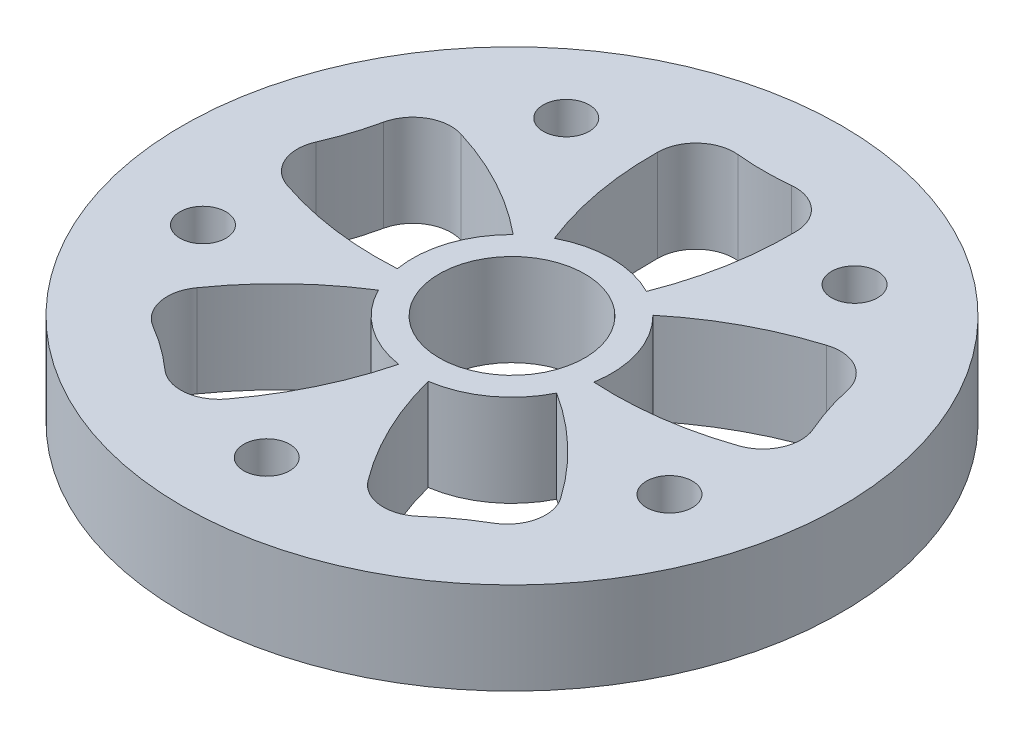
ISO-10303-21;
HEADER;
FILE_DESCRIPTION(('STEP AP214'),'2;1');
FILE_NAME('part.step','',(''),(''),'','','');
FILE_SCHEMA(('AUTOMOTIVE_DESIGN { 1 0 10303 214 1 1 1 1 }'));
ENDSEC;
DATA;
#1=APPLICATION_CONTEXT('core data for automotive mechanical design processes');
#2=APPLICATION_PROTOCOL_DEFINITION('international standard','automotive_design',2000,#1);
#3=PRODUCT_CONTEXT('',#1,'mechanical');
#4=PRODUCT('Part','Part','',(#3));
#5=PRODUCT_RELATED_PRODUCT_CATEGORY('part','',(#4));
#6=PRODUCT_DEFINITION_FORMATION('','',#4);
#7=PRODUCT_DEFINITION_CONTEXT('part definition',#1,'design');
#8=PRODUCT_DEFINITION('design','',#6,#7);
#9=PRODUCT_DEFINITION_SHAPE('','',#8);
#10=(LENGTH_UNIT() NAMED_UNIT(*) SI_UNIT(.MILLI.,.METRE.));
#11=(NAMED_UNIT(*) PLANE_ANGLE_UNIT() SI_UNIT($,.RADIAN.));
#12=(NAMED_UNIT(*) SI_UNIT($,.STERADIAN.) SOLID_ANGLE_UNIT());
#13=UNCERTAINTY_MEASURE_WITH_UNIT(LENGTH_MEASURE(1.E-05),#10,'distance_accuracy_value','');
#14=(GEOMETRIC_REPRESENTATION_CONTEXT(3) GLOBAL_UNCERTAINTY_ASSIGNED_CONTEXT((#13)) GLOBAL_UNIT_ASSIGNED_CONTEXT((#10,
#11,#12)) REPRESENTATION_CONTEXT('',''));
#15=CARTESIAN_POINT('',(0.,0.,0.));
#16=DIRECTION('',(0.,0.,1.));
#17=DIRECTION('',(1.,0.,0.));
#18=AXIS2_PLACEMENT_3D('',#15,#16,#17);
#19=CARTESIAN_POINT('',(0.,6.,0.));
#20=DIRECTION('',(0.,1.,0.));
#21=DIRECTION('',(0.,0.,1.));
#22=AXIS2_PLACEMENT_3D('',#19,#20,#21);
#23=PLANE('',#22);
#24=CARTESIAN_POINT('',(-15.4833344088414,6.,-40.7749964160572));
#25=DIRECTION('',(0.,1.,0.));
#26=DIRECTION('',(0.,0.,-1.));
#27=AXIS2_PLACEMENT_3D('',#24,#25,#26);
#28=CIRCLE('',#27,43.);
#29=CARTESIAN_POINT('',(-29.4107354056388,6.,-0.0929671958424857));
#30=VERTEX_POINT('',#29);
#31=CARTESIAN_POINT('',(-12.8222207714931,6.,2.14258126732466));
#32=VERTEX_POINT('',#31);
#33=EDGE_CURVE('E63',#30,#32,#28,.T.);
#34=ORIENTED_EDGE('',*,*,#33,.F.);
#35=CARTESIAN_POINT('',(-27.865650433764,6.,-4.84824977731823));
#36=DIRECTION('',(0.,1.,0.));
#37=DIRECTION('',(0.,0.,-1.));
#38=AXIS2_PLACEMENT_3D('',#35,#36,#37);
#39=CIRCLE('',#38,5.);
#40=CARTESIAN_POINT('',(-32.4425883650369,6.,-6.86111817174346));
#41=VERTEX_POINT('',#40);
#42=EDGE_CURVE('E482',#41,#30,#39,.T.);
#43=ORIENTED_EDGE('',*,*,#42,.F.);
#44=CARTESIAN_POINT('',(-64.4811538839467,6.,-20.95119693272));
#45=DIRECTION('',(0.,-1.,0.));
#46=DIRECTION('',(0.,0.,1.));
#47=AXIS2_PLACEMENT_3D('',#44,#45,#46);
#48=CIRCLE('',#47,35.);
#49=CARTESIAN_POINT('',(-30.2794694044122,6.,-13.5185137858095));
#50=VERTEX_POINT('',#49);
#51=EDGE_CURVE('E488',#50,#41,#48,.T.);
#52=ORIENTED_EDGE('',*,*,#51,.F.);
#53=CARTESIAN_POINT('',(-25.3935144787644,6.,-12.4567019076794));
#54=DIRECTION('',(0.,1.,0.));
#55=DIRECTION('',(0.,0.,1.));
#56=AXIS2_PLACEMENT_3D('',#53,#54,#55);
#57=CIRCLE('',#56,5.);
#58=CARTESIAN_POINT('',(-23.8484295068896,6.,-17.2119844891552));
#59=VERTEX_POINT('',#58);
#60=EDGE_CURVE('E495',#59,#50,#57,.T.);
#61=ORIENTED_EDGE('',*,*,#60,.F.);
#62=CARTESIAN_POINT('',(-36.4932222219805,6.,23.8867894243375));
#63=DIRECTION('',(0.,1.,0.));
#64=DIRECTION('',(0.,0.,1.));
#65=AXIS2_PLACEMENT_3D('',#62,#63,#64);
#66=CIRCLE('',#65,43.);
#67=CARTESIAN_POINT('',(-9.11401683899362,6.,-9.27009692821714));
#68=VERTEX_POINT('',#67);
#69=EDGE_CURVE('E497',#68,#59,#66,.T.);
#70=ORIENTED_EDGE('',*,*,#69,.F.);
#71=CARTESIAN_POINT('',(0.,6.,0.));
#72=DIRECTION('',(0.,-1.,0.));
#73=DIRECTION('',(0.,0.,1.));
#74=AXIS2_PLACEMENT_3D('',#71,#72,#73);
#75=CIRCLE('',#74,13.);
#76=EDGE_CURVE('E498',#32,#68,#75,.T.);
#77=ORIENTED_EDGE('',*,*,#76,.F.);
#78=EDGE_LOOP('',(#34,#43,#52,#61,#70,#77));
#79=FACE_BOUND('',#78,.T.);
#80=CARTESIAN_POINT('',(0.,6.,0.));
#81=DIRECTION('',(0.,-1.,0.));
#82=DIRECTION('',(0.,0.,1.));
#83=AXIS2_PLACEMENT_3D('',#80,#81,#82);
#84=CIRCLE('',#83,13.);
#85=CARTESIAN_POINT('',(-1.92456824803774,6.,12.8567506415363));
#86=VERTEX_POINT('',#85);
#87=CARTESIAN_POINT('',(-11.632772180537,6.,5.80332761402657));
#88=VERTEX_POINT('',#87);
#89=EDGE_CURVE('E66',#86,#88,#84,.T.);
#90=ORIENTED_EDGE('',*,*,#89,.F.);
#91=CARTESIAN_POINT('',(-43.5639395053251,6.,2.12535924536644));
#92=DIRECTION('',(0.,1.,0.));
#93=DIRECTION('',(0.,0.,-1.));
#94=AXIS2_PLACEMENT_3D('',#91,#92,#93);
#95=CIRCLE('',#94,43.);
#96=CARTESIAN_POINT('',(-9.17683411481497,6.,27.9425431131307));
#97=VERTEX_POINT('',#96);
#98=EDGE_CURVE('E419',#97,#86,#95,.T.);
#99=ORIENTED_EDGE('',*,*,#98,.F.);
#100=CARTESIAN_POINT('',(-13.2219190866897,6.,25.0036168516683));
#101=DIRECTION('',(0.,1.,0.));
#102=DIRECTION('',(0.,0.,-1.));
#103=AXIS2_PLACEMENT_3D('',#100,#101,#102);
#104=CIRCLE('',#103,5.);
#105=CARTESIAN_POINT('',(-16.550622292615,6.,28.7345329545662));
#106=VERTEX_POINT('',#105);
#107=EDGE_CURVE('E424',#106,#97,#104,.T.);
#108=ORIENTED_EDGE('',*,*,#107,.F.);
#109=CARTESIAN_POINT('',(-39.851544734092,6.,54.8509456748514));
#110=DIRECTION('',(0.,-1.,0.));
#111=DIRECTION('',(0.,0.,1.));
#112=AXIS2_PLACEMENT_3D('',#109,#110,#111);
#113=CIRCLE('',#112,35.);
#114=CARTESIAN_POINT('',(-22.2137412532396,6.,24.6200361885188));
#115=VERTEX_POINT('',#114);
#116=EDGE_CURVE('E428',#115,#106,#113,.T.);
#117=ORIENTED_EDGE('',*,*,#116,.F.);
#118=CARTESIAN_POINT('',(-19.6940550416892,6.,20.3013348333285));
#119=DIRECTION('',(0.,1.,0.));
#120=DIRECTION('',(0.,0.,1.));
#121=AXIS2_PLACEMENT_3D('',#118,#119,#120);
#122=CIRCLE('',#121,5.);
#123=CARTESIAN_POINT('',(-23.7391400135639,6.,17.3624085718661));
#124=VERTEX_POINT('',#123);
#125=EDGE_CURVE('E435',#124,#115,#122,.T.);
#126=ORIENTED_EDGE('',*,*,#125,.F.);
#127=CARTESIAN_POINT('',(11.440660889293,6.,42.0885406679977));
#128=DIRECTION('',(0.,1.,0.));
#129=DIRECTION('',(0.,0.,1.));
#130=AXIS2_PLACEMENT_3D('',#127,#128,#129);
#131=CIRCLE('',#130,43.);
#132=EDGE_CURVE('E436',#88,#124,#131,.T.);
#133=ORIENTED_EDGE('',*,*,#132,.F.);
#134=EDGE_LOOP('',(#90,#99,#108,#117,#126,#133));
#135=FACE_BOUND('',#134,.T.);
#136=CARTESIAN_POINT('',(0.,6.,0.));
#137=DIRECTION('',(0.,-1.,0.));
#138=DIRECTION('',(0.,0.,1.));
#139=AXIS2_PLACEMENT_3D('',#136,#137,#138);
#140=CIRCLE('',#139,13.);
#141=CARTESIAN_POINT('',(11.632772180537,6.,5.80332761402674));
#142=VERTEX_POINT('',#141);
#143=CARTESIAN_POINT('',(1.92456824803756,6.,12.8567506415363));
#144=VERTEX_POINT('',#143);
#145=EDGE_CURVE('E254',#142,#144,#140,.T.);
#146=ORIENTED_EDGE('',*,*,#145,.F.);
#147=CARTESIAN_POINT('',(-11.4406608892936,6.,42.0885406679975));
#148=DIRECTION('',(0.,1.,0.));
#149=DIRECTION('',(0.,0.,-1.));
#150=AXIS2_PLACEMENT_3D('',#147,#148,#149);
#151=CIRCLE('',#150,43.);
#152=CARTESIAN_POINT('',(23.7391400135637,6.,17.3624085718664));
#153=VERTEX_POINT('',#152);
#154=EDGE_CURVE('E357',#153,#142,#151,.T.);
#155=ORIENTED_EDGE('',*,*,#154,.F.);
#156=CARTESIAN_POINT('',(19.6940550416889,6.,20.3013348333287));
#157=DIRECTION('',(0.,1.,0.));
#158=DIRECTION('',(0.,0.,-1.));
#159=AXIS2_PLACEMENT_3D('',#156,#157,#158);
#160=CIRCLE('',#159,5.);
#161=CARTESIAN_POINT('',(22.2137412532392,6.,24.6200361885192));
#162=VERTEX_POINT('',#161);
#163=EDGE_CURVE('E358',#162,#153,#160,.T.);
#164=ORIENTED_EDGE('',*,*,#163,.F.);
#165=CARTESIAN_POINT('',(39.8515447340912,6.,54.8509456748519));
#166=DIRECTION('',(0.,-1.,0.));
#167=DIRECTION('',(0.,0.,1.));
#168=AXIS2_PLACEMENT_3D('',#165,#166,#167);
#169=CIRCLE('',#168,35.);
#170=CARTESIAN_POINT('',(16.5506222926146,6.,28.7345329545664));
#171=VERTEX_POINT('',#170);
#172=EDGE_CURVE('E365',#171,#162,#169,.T.);
#173=ORIENTED_EDGE('',*,*,#172,.F.);
#174=CARTESIAN_POINT('',(13.2219190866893,6.,25.0036168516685));
#175=DIRECTION('',(0.,1.,0.));
#176=DIRECTION('',(0.,0.,1.));
#177=AXIS2_PLACEMENT_3D('',#174,#175,#176);
#178=CIRCLE('',#177,5.);
#179=CARTESIAN_POINT('',(9.17683411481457,6.,27.9425431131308));
#180=VERTEX_POINT('',#179);
#181=EDGE_CURVE('E366',#180,#171,#178,.T.);
#182=ORIENTED_EDGE('',*,*,#181,.F.);
#183=CARTESIAN_POINT('',(43.5639395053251,6.,2.12535924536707));
#184=DIRECTION('',(0.,1.,0.));
#185=DIRECTION('',(0.,0.,1.));
#186=AXIS2_PLACEMENT_3D('',#183,#184,#185);
#187=CIRCLE('',#186,43.);
#188=EDGE_CURVE('E375',#144,#180,#187,.T.);
#189=ORIENTED_EDGE('',*,*,#188,.F.);
#190=EDGE_LOOP('',(#146,#155,#164,#173,#182,#189));
#191=FACE_BOUND('',#190,.T.);
#192=CARTESIAN_POINT('',(0.,6.,0.));
#193=DIRECTION('',(0.,-1.,0.));
#194=DIRECTION('',(0.,0.,1.));
#195=AXIS2_PLACEMENT_3D('',#192,#193,#194);
#196=CIRCLE('',#195,13.);
#197=CARTESIAN_POINT('',(9.11401683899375,6.,-9.27009692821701));
#198=VERTEX_POINT('',#197);
#199=CARTESIAN_POINT('',(12.8222207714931,6.,2.14258126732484));
#200=VERTEX_POINT('',#199);
#201=EDGE_CURVE('E310',#198,#200,#196,.T.);
#202=ORIENTED_EDGE('',*,*,#201,.F.);
#203=CARTESIAN_POINT('',(36.4932222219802,6.,23.886789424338));
#204=DIRECTION('',(0.,1.,0.));
#205=DIRECTION('',(0.,0.,-1.));
#206=AXIS2_PLACEMENT_3D('',#203,#204,#205);
#207=CIRCLE('',#206,43.);
#208=CARTESIAN_POINT('',(23.8484295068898,6.,-17.2119844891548));
#209=VERTEX_POINT('',#208);
#210=EDGE_CURVE('E248',#209,#198,#207,.T.);
#211=ORIENTED_EDGE('',*,*,#210,.F.);
#212=CARTESIAN_POINT('',(25.3935144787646,6.,-12.4567019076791));
#213=DIRECTION('',(0.,1.,0.));
#214=DIRECTION('',(0.,0.,-1.));
#215=AXIS2_PLACEMENT_3D('',#212,#213,#214);
#216=CIRCLE('',#215,5.);
#217=CARTESIAN_POINT('',(30.2794694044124,6.,-13.5185137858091));
#218=VERTEX_POINT('',#217);
#219=EDGE_CURVE('E291',#218,#209,#216,.T.);
#220=ORIENTED_EDGE('',*,*,#219,.F.);
#221=CARTESIAN_POINT('',(64.481153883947,6.,-20.9511969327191));
#222=DIRECTION('',(0.,-1.,0.));
#223=DIRECTION('',(0.,0.,1.));
#224=AXIS2_PLACEMENT_3D('',#221,#222,#223);
#225=CIRCLE('',#224,35.);
#226=CARTESIAN_POINT('',(32.442588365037,6.,-6.861118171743));
#227=VERTEX_POINT('',#226);
#228=EDGE_CURVE('E299',#227,#218,#225,.T.);
#229=ORIENTED_EDGE('',*,*,#228,.F.);
#230=CARTESIAN_POINT('',(27.8656504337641,6.,-4.84824977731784));
#231=DIRECTION('',(0.,1.,0.));
#232=DIRECTION('',(0.,0.,1.));
#233=AXIS2_PLACEMENT_3D('',#230,#231,#232);
#234=CIRCLE('',#233,5.);
#235=CARTESIAN_POINT('',(29.4107354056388,6.,-0.0929671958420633));
#236=VERTEX_POINT('',#235);
#237=EDGE_CURVE('E302',#236,#227,#234,.T.);
#238=ORIENTED_EDGE('',*,*,#237,.F.);
#239=CARTESIAN_POINT('',(15.483334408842,6.,-40.774996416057));
#240=DIRECTION('',(0.,1.,0.));
#241=DIRECTION('',(0.,0.,1.));
#242=AXIS2_PLACEMENT_3D('',#239,#240,#241);
#243=CIRCLE('',#242,43.);
#244=EDGE_CURVE('E303',#200,#236,#243,.T.);
#245=ORIENTED_EDGE('',*,*,#244,.F.);
#246=EDGE_LOOP('',(#202,#211,#220,#229,#238,#245));
#247=FACE_BOUND('',#246,.T.);
#248=CARTESIAN_POINT('',(0.,6.,0.));
#249=DIRECTION('',(0.,-1.,0.));
#250=DIRECTION('',(0.,0.,1.));
#251=AXIS2_PLACEMENT_3D('',#248,#249,#250);
#252=CIRCLE('',#251,13.);
#253=CARTESIAN_POINT('',(-6.,6.,-11.5325625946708));
#254=VERTEX_POINT('',#253);
#255=CARTESIAN_POINT('',(5.99999999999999,6.,-11.5325625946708));
#256=VERTEX_POINT('',#255);
#257=EDGE_CURVE('E315',#254,#256,#252,.T.);
#258=ORIENTED_EDGE('',*,*,#257,.F.);
#259=CARTESIAN_POINT('',(33.9947125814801,6.,-27.3256929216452));
#260=DIRECTION('',(0.,1.,0.));
#261=DIRECTION('',(0.,0.,-1.));
#262=AXIS2_PLACEMENT_3D('',#259,#260,#261);
#263=CIRCLE('',#262,43.);
#264=CARTESIAN_POINT('',(-8.99999999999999,6.,-28.));
#265=VERTEX_POINT('',#264);
#266=EDGE_CURVE('E521',#265,#254,#263,.T.);
#267=ORIENTED_EDGE('',*,*,#266,.F.);
#268=CARTESIAN_POINT('',(-3.99999999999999,6.,-28.));
#269=DIRECTION('',(0.,1.,0.));
#270=DIRECTION('',(0.,0.,-1.));
#271=AXIS2_PLACEMENT_3D('',#268,#269,#270);
#272=CIRCLE('',#271,5.);
#273=CARTESIAN_POINT('',(-3.49999999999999,6.,-32.9749371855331));
#274=VERTEX_POINT('',#273);
#275=EDGE_CURVE('E516',#274,#265,#272,.T.);
#276=ORIENTED_EDGE('',*,*,#275,.F.);
#277=CARTESIAN_POINT('',(0.,6.,-67.7994974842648));
#278=DIRECTION('',(0.,-1.,0.));
#279=DIRECTION('',(0.,0.,1.));
#280=AXIS2_PLACEMENT_3D('',#277,#278,#279);
#281=CIRCLE('',#280,35.);
#282=CARTESIAN_POINT('',(3.5,6.,-32.9749371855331));
#283=VERTEX_POINT('',#282);
#284=EDGE_CURVE('E518',#283,#274,#281,.T.);
#285=ORIENTED_EDGE('',*,*,#284,.F.);
#286=CARTESIAN_POINT('',(3.99999999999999,6.,-28.));
#287=DIRECTION('',(0.,1.,0.));
#288=DIRECTION('',(0.,0.,1.));
#289=AXIS2_PLACEMENT_3D('',#286,#287,#288);
#290=CIRCLE('',#289,5.);
#291=CARTESIAN_POINT('',(8.99999999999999,6.,-28.));
#292=VERTEX_POINT('',#291);
#293=EDGE_CURVE('E515',#292,#283,#290,.T.);
#294=ORIENTED_EDGE('',*,*,#293,.F.);
#295=CARTESIAN_POINT('',(-33.9947125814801,6.,-27.3256929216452));
#296=DIRECTION('',(0.,1.,0.));
#297=DIRECTION('',(0.,0.,1.));
#298=AXIS2_PLACEMENT_3D('',#295,#296,#297);
#299=CIRCLE('',#298,43.);
#300=EDGE_CURVE('E509',#256,#292,#299,.T.);
#301=ORIENTED_EDGE('',*,*,#300,.F.);
#302=EDGE_LOOP('',(#258,#267,#276,#285,#294,#301));
#303=FACE_BOUND('',#302,.T.);
#304=CARTESIAN_POINT('',(18.8091280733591,6.,-25.8885438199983));
#305=DIRECTION('',(0.,1.,0.));
#306=DIRECTION('',(0.,0.,1.));
#307=AXIS2_PLACEMENT_3D('',#304,#305,#306);
#308=CIRCLE('',#307,3.);
#309=CARTESIAN_POINT('',(18.8091280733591,6.,-22.8885438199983));
#310=VERTEX_POINT('',#309);
#311=EDGE_CURVE('E578',#310,#310,#308,.T.);
#312=ORIENTED_EDGE('',*,*,#311,.F.);
#313=EDGE_LOOP('',(#312));
#314=FACE_BOUND('',#313,.T.);
#315=CARTESIAN_POINT('',(-30.4338085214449,6.,9.88854381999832));
#316=DIRECTION('',(0.,1.,0.));
#317=DIRECTION('',(0.,0.,1.));
#318=AXIS2_PLACEMENT_3D('',#315,#316,#317);
#319=CIRCLE('',#318,3.);
#320=CARTESIAN_POINT('',(-30.4338085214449,6.,12.8885438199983));
#321=VERTEX_POINT('',#320);
#322=EDGE_CURVE('E596',#321,#321,#319,.T.);
#323=ORIENTED_EDGE('',*,*,#322,.F.);
#324=EDGE_LOOP('',(#323));
#325=FACE_BOUND('',#324,.T.);
#326=CARTESIAN_POINT('',(0.,6.,0.));
#327=DIRECTION('',(0.,1.,0.));
#328=DIRECTION('',(0.,0.,1.));
#329=AXIS2_PLACEMENT_3D('',#326,#327,#328);
#330=CIRCLE('',#329,9.5);
#331=CARTESIAN_POINT('',(0.,6.,9.5));
#332=VERTEX_POINT('',#331);
#333=EDGE_CURVE('E614',#332,#332,#330,.T.);
#334=ORIENTED_EDGE('',*,*,#333,.F.);
#335=EDGE_LOOP('',(#334));
#336=FACE_BOUND('',#335,.T.);
#337=CARTESIAN_POINT('',(0.,6.,0.));
#338=DIRECTION('',(0.,1.,0.));
#339=DIRECTION('',(0.,0.,1.));
#340=AXIS2_PLACEMENT_3D('',#337,#338,#339);
#341=CIRCLE('',#340,43.);
#342=CARTESIAN_POINT('',(0.,6.,43.));
#343=VERTEX_POINT('',#342);
#344=EDGE_CURVE('E11',#343,#343,#341,.T.);
#345=ORIENTED_EDGE('',*,*,#344,.T.);
#346=EDGE_LOOP('',(#345));
#347=FACE_BOUND('',#346,.T.);
#348=CARTESIAN_POINT('',(0.,6.,32.));
#349=DIRECTION('',(0.,1.,0.));
#350=DIRECTION('',(0.,0.,1.));
#351=AXIS2_PLACEMENT_3D('',#348,#349,#350);
#352=CIRCLE('',#351,3.);
#353=CARTESIAN_POINT('',(0.,6.,35.));
#354=VERTEX_POINT('',#353);
#355=EDGE_CURVE('E603',#354,#354,#352,.T.);
#356=ORIENTED_EDGE('',*,*,#355,.F.);
#357=EDGE_LOOP('',(#356));
#358=FACE_BOUND('',#357,.T.);
#359=CARTESIAN_POINT('',(-18.8091280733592,6.,-25.8885438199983));
#360=DIRECTION('',(0.,1.,0.));
#361=DIRECTION('',(0.,0.,1.));
#362=AXIS2_PLACEMENT_3D('',#359,#360,#361);
#363=CIRCLE('',#362,3.);
#364=CARTESIAN_POINT('',(-18.8091280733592,6.,-22.8885438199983));
#365=VERTEX_POINT('',#364);
#366=EDGE_CURVE('E586',#365,#365,#363,.T.);
#367=ORIENTED_EDGE('',*,*,#366,.F.);
#368=EDGE_LOOP('',(#367));
#369=FACE_BOUND('',#368,.T.);
#370=CARTESIAN_POINT('',(30.4338085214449,6.,9.88854381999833));
#371=DIRECTION('',(0.,1.,0.));
#372=DIRECTION('',(0.,0.,1.));
#373=AXIS2_PLACEMENT_3D('',#370,#371,#372);
#374=CIRCLE('',#373,2.99999999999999);
#375=CARTESIAN_POINT('',(30.4338085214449,6.,12.8885438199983));
#376=VERTEX_POINT('',#375);
#377=EDGE_CURVE('E574',#376,#376,#374,.T.);
#378=ORIENTED_EDGE('',*,*,#377,.F.);
#379=EDGE_LOOP('',(#378));
#380=FACE_BOUND('',#379,.T.);
#381=ADVANCED_FACE('F44',(#79,#135,#191,#247,#303,#314,#325,#336,#347,#358,#369,#380),#23,.T.);
#382=CARTESIAN_POINT('',(0.,-6.,0.));
#383=DIRECTION('',(0.,1.,0.));
#384=DIRECTION('',(0.,0.,1.));
#385=AXIS2_PLACEMENT_3D('',#382,#383,#384);
#386=PLANE('',#385);
#387=CARTESIAN_POINT('',(-27.865650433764,-6.,-4.84824977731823));
#388=DIRECTION('',(0.,1.,0.));
#389=DIRECTION('',(0.,0.,-1.));
#390=AXIS2_PLACEMENT_3D('',#387,#388,#389);
#391=CIRCLE('',#390,5.);
#392=CARTESIAN_POINT('',(-32.4425883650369,-6.,-6.86111817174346));
#393=VERTEX_POINT('',#392);
#394=CARTESIAN_POINT('',(-29.4107354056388,-6.,-0.0929671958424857));
#395=VERTEX_POINT('',#394);
#396=EDGE_CURVE('E443',#393,#395,#391,.T.);
#397=ORIENTED_EDGE('',*,*,#396,.T.);
#398=CARTESIAN_POINT('',(-15.4833344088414,-6.,-40.7749964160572));
#399=DIRECTION('',(0.,1.,0.));
#400=DIRECTION('',(0.,0.,-1.));
#401=AXIS2_PLACEMENT_3D('',#398,#399,#400);
#402=CIRCLE('',#401,43.);
#403=CARTESIAN_POINT('',(-12.8222207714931,-6.,2.14258126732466));
#404=VERTEX_POINT('',#403);
#405=EDGE_CURVE('E477',#395,#404,#402,.T.);
#406=ORIENTED_EDGE('',*,*,#405,.T.);
#407=CARTESIAN_POINT('',(0.,-6.,0.));
#408=DIRECTION('',(0.,-1.,0.));
#409=DIRECTION('',(0.,0.,1.));
#410=AXIS2_PLACEMENT_3D('',#407,#408,#409);
#411=CIRCLE('',#410,13.);
#412=CARTESIAN_POINT('',(-9.11401683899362,-6.,-9.27009692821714));
#413=VERTEX_POINT('',#412);
#414=EDGE_CURVE('E478',#404,#413,#411,.T.);
#415=ORIENTED_EDGE('',*,*,#414,.T.);
#416=CARTESIAN_POINT('',(-36.4932222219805,-6.,23.8867894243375));
#417=DIRECTION('',(0.,1.,0.));
#418=DIRECTION('',(0.,0.,1.));
#419=AXIS2_PLACEMENT_3D('',#416,#417,#418);
#420=CIRCLE('',#419,43.);
#421=CARTESIAN_POINT('',(-23.8484295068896,-6.,-17.2119844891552));
#422=VERTEX_POINT('',#421);
#423=EDGE_CURVE('E472',#413,#422,#420,.T.);
#424=ORIENTED_EDGE('',*,*,#423,.T.);
#425=CARTESIAN_POINT('',(-25.3935144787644,-6.,-12.4567019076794));
#426=DIRECTION('',(0.,1.,0.));
#427=DIRECTION('',(0.,0.,1.));
#428=AXIS2_PLACEMENT_3D('',#425,#426,#427);
#429=CIRCLE('',#428,5.);
#430=CARTESIAN_POINT('',(-30.2794694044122,-6.,-13.5185137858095));
#431=VERTEX_POINT('',#430);
#432=EDGE_CURVE('E469',#422,#431,#429,.T.);
#433=ORIENTED_EDGE('',*,*,#432,.T.);
#434=CARTESIAN_POINT('',(-64.4811538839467,-6.,-20.95119693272));
#435=DIRECTION('',(0.,-1.,0.));
#436=DIRECTION('',(0.,0.,1.));
#437=AXIS2_PLACEMENT_3D('',#434,#435,#436);
#438=CIRCLE('',#437,35.);
#439=EDGE_CURVE('E465',#431,#393,#438,.T.);
#440=ORIENTED_EDGE('',*,*,#439,.T.);
#441=EDGE_LOOP('',(#397,#406,#415,#424,#433,#440));
#442=FACE_BOUND('',#441,.T.);
#443=CARTESIAN_POINT('',(-43.5639395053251,-6.,2.12535924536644));
#444=DIRECTION('',(0.,1.,0.));
#445=DIRECTION('',(0.,0.,-1.));
#446=AXIS2_PLACEMENT_3D('',#443,#444,#445);
#447=CIRCLE('',#446,43.);
#448=CARTESIAN_POINT('',(-9.17683411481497,-6.,27.9425431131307));
#449=VERTEX_POINT('',#448);
#450=CARTESIAN_POINT('',(-1.92456824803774,-6.,12.8567506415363));
#451=VERTEX_POINT('',#450);
#452=EDGE_CURVE('E381',#449,#451,#447,.T.);
#453=ORIENTED_EDGE('',*,*,#452,.T.);
#454=CARTESIAN_POINT('',(0.,-6.,0.));
#455=DIRECTION('',(0.,-1.,0.));
#456=DIRECTION('',(0.,0.,1.));
#457=AXIS2_PLACEMENT_3D('',#454,#455,#456);
#458=CIRCLE('',#457,13.);
#459=CARTESIAN_POINT('',(-11.632772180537,-6.,5.80332761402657));
#460=VERTEX_POINT('',#459);
#461=EDGE_CURVE('E418',#451,#460,#458,.T.);
#462=ORIENTED_EDGE('',*,*,#461,.T.);
#463=CARTESIAN_POINT('',(11.440660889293,-6.,42.0885406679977));
#464=DIRECTION('',(0.,1.,0.));
#465=DIRECTION('',(0.,0.,1.));
#466=AXIS2_PLACEMENT_3D('',#463,#464,#465);
#467=CIRCLE('',#466,43.);
#468=CARTESIAN_POINT('',(-23.7391400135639,-6.,17.3624085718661));
#469=VERTEX_POINT('',#468);
#470=EDGE_CURVE('E415',#460,#469,#467,.T.);
#471=ORIENTED_EDGE('',*,*,#470,.T.);
#472=CARTESIAN_POINT('',(-19.6940550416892,-6.,20.3013348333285));
#473=DIRECTION('',(0.,1.,0.));
#474=DIRECTION('',(0.,0.,1.));
#475=AXIS2_PLACEMENT_3D('',#472,#473,#474);
#476=CIRCLE('',#475,5.);
#477=CARTESIAN_POINT('',(-22.2137412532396,-6.,24.6200361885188));
#478=VERTEX_POINT('',#477);
#479=EDGE_CURVE('E407',#469,#478,#476,.T.);
#480=ORIENTED_EDGE('',*,*,#479,.T.);
#481=CARTESIAN_POINT('',(-39.851544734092,-6.,54.8509456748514));
#482=DIRECTION('',(0.,-1.,0.));
#483=DIRECTION('',(0.,0.,1.));
#484=AXIS2_PLACEMENT_3D('',#481,#482,#483);
#485=CIRCLE('',#484,35.);
#486=CARTESIAN_POINT('',(-16.550622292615,-6.,28.7345329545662));
#487=VERTEX_POINT('',#486);
#488=EDGE_CURVE('E404',#478,#487,#485,.T.);
#489=ORIENTED_EDGE('',*,*,#488,.T.);
#490=CARTESIAN_POINT('',(-13.2219190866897,-6.,25.0036168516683));
#491=DIRECTION('',(0.,1.,0.));
#492=DIRECTION('',(0.,0.,-1.));
#493=AXIS2_PLACEMENT_3D('',#490,#491,#492);
#494=CIRCLE('',#493,5.);
#495=EDGE_CURVE('E398',#487,#449,#494,.T.);
#496=ORIENTED_EDGE('',*,*,#495,.T.);
#497=EDGE_LOOP('',(#453,#462,#471,#480,#489,#496));
#498=FACE_BOUND('',#497,.T.);
#499=CARTESIAN_POINT('',(-11.4406608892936,-6.,42.0885406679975));
#500=DIRECTION('',(0.,1.,0.));
#501=DIRECTION('',(0.,0.,-1.));
#502=AXIS2_PLACEMENT_3D('',#499,#500,#501);
#503=CIRCLE('',#502,43.);
#504=CARTESIAN_POINT('',(23.7391400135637,-6.,17.3624085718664));
#505=VERTEX_POINT('',#504);
#506=CARTESIAN_POINT('',(11.632772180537,-6.,5.80332761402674));
#507=VERTEX_POINT('',#506);
#508=EDGE_CURVE('E320',#505,#507,#503,.T.);
#509=ORIENTED_EDGE('',*,*,#508,.T.);
#510=CARTESIAN_POINT('',(0.,-6.,0.));
#511=DIRECTION('',(0.,-1.,0.));
#512=DIRECTION('',(0.,0.,1.));
#513=AXIS2_PLACEMENT_3D('',#510,#511,#512);
#514=CIRCLE('',#513,13.);
#515=CARTESIAN_POINT('',(1.92456824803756,-6.,12.8567506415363));
#516=VERTEX_POINT('',#515);
#517=EDGE_CURVE('E354',#507,#516,#514,.T.);
#518=ORIENTED_EDGE('',*,*,#517,.T.);
#519=CARTESIAN_POINT('',(43.5639395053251,-6.,2.12535924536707));
#520=DIRECTION('',(0.,1.,0.));
#521=DIRECTION('',(0.,0.,1.));
#522=AXIS2_PLACEMENT_3D('',#519,#520,#521);
#523=CIRCLE('',#522,43.);
#524=CARTESIAN_POINT('',(9.17683411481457,-6.,27.9425431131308));
#525=VERTEX_POINT('',#524);
#526=EDGE_CURVE('E346',#516,#525,#523,.T.);
#527=ORIENTED_EDGE('',*,*,#526,.T.);
#528=CARTESIAN_POINT('',(13.2219190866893,-6.,25.0036168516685));
#529=DIRECTION('',(0.,1.,0.));
#530=DIRECTION('',(0.,0.,1.));
#531=AXIS2_PLACEMENT_3D('',#528,#529,#530);
#532=CIRCLE('',#531,5.);
#533=CARTESIAN_POINT('',(16.5506222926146,-6.,28.7345329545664));
#534=VERTEX_POINT('',#533);
#535=EDGE_CURVE('E341',#525,#534,#532,.T.);
#536=ORIENTED_EDGE('',*,*,#535,.T.);
#537=CARTESIAN_POINT('',(39.8515447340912,-6.,54.8509456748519));
#538=DIRECTION('',(0.,-1.,0.));
#539=DIRECTION('',(0.,0.,1.));
#540=AXIS2_PLACEMENT_3D('',#537,#538,#539);
#541=CIRCLE('',#540,35.);
#542=CARTESIAN_POINT('',(22.2137412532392,-6.,24.6200361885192));
#543=VERTEX_POINT('',#542);
#544=EDGE_CURVE('E336',#534,#543,#541,.T.);
#545=ORIENTED_EDGE('',*,*,#544,.T.);
#546=CARTESIAN_POINT('',(19.6940550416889,-6.,20.3013348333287));
#547=DIRECTION('',(0.,1.,0.));
#548=DIRECTION('',(0.,0.,-1.));
#549=AXIS2_PLACEMENT_3D('',#546,#547,#548);
#550=CIRCLE('',#549,5.);
#551=EDGE_CURVE('E338',#543,#505,#550,.T.);
#552=ORIENTED_EDGE('',*,*,#551,.T.);
#553=EDGE_LOOP('',(#509,#518,#527,#536,#545,#552));
#554=FACE_BOUND('',#553,.T.);
#555=CARTESIAN_POINT('',(36.4932222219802,-6.,23.886789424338));
#556=DIRECTION('',(0.,1.,0.));
#557=DIRECTION('',(0.,0.,-1.));
#558=AXIS2_PLACEMENT_3D('',#555,#556,#557);
#559=CIRCLE('',#558,43.);
#560=CARTESIAN_POINT('',(23.8484295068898,-6.,-17.2119844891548));
#561=VERTEX_POINT('',#560);
#562=CARTESIAN_POINT('',(9.11401683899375,-6.,-9.27009692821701));
#563=VERTEX_POINT('',#562);
#564=EDGE_CURVE('E250',#561,#563,#559,.T.);
#565=ORIENTED_EDGE('',*,*,#564,.T.);
#566=CARTESIAN_POINT('',(0.,-6.,0.));
#567=DIRECTION('',(0.,-1.,0.));
#568=DIRECTION('',(0.,0.,1.));
#569=AXIS2_PLACEMENT_3D('',#566,#567,#568);
#570=CIRCLE('',#569,13.);
#571=CARTESIAN_POINT('',(12.8222207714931,-6.,2.14258126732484));
#572=VERTEX_POINT('',#571);
#573=EDGE_CURVE('E256',#563,#572,#570,.T.);
#574=ORIENTED_EDGE('',*,*,#573,.T.);
#575=CARTESIAN_POINT('',(15.483334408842,-6.,-40.774996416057));
#576=DIRECTION('',(0.,1.,0.));
#577=DIRECTION('',(0.,0.,1.));
#578=AXIS2_PLACEMENT_3D('',#575,#576,#577);
#579=CIRCLE('',#578,43.);
#580=CARTESIAN_POINT('',(29.4107354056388,-6.,-0.0929671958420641));
#581=VERTEX_POINT('',#580);
#582=EDGE_CURVE('E266',#572,#581,#579,.T.);
#583=ORIENTED_EDGE('',*,*,#582,.T.);
#584=CARTESIAN_POINT('',(27.8656504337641,-6.,-4.84824977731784));
#585=DIRECTION('',(0.,1.,0.));
#586=DIRECTION('',(0.,0.,1.));
#587=AXIS2_PLACEMENT_3D('',#584,#585,#586);
#588=CIRCLE('',#587,5.);
#589=CARTESIAN_POINT('',(32.442588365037,-6.,-6.861118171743));
#590=VERTEX_POINT('',#589);
#591=EDGE_CURVE('E281',#581,#590,#588,.T.);
#592=ORIENTED_EDGE('',*,*,#591,.T.);
#593=CARTESIAN_POINT('',(64.481153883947,-6.,-20.9511969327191));
#594=DIRECTION('',(0.,-1.,0.));
#595=DIRECTION('',(0.,0.,1.));
#596=AXIS2_PLACEMENT_3D('',#593,#594,#595);
#597=CIRCLE('',#596,35.);
#598=CARTESIAN_POINT('',(30.2794694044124,-6.,-13.5185137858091));
#599=VERTEX_POINT('',#598);
#600=EDGE_CURVE('E280',#590,#599,#597,.T.);
#601=ORIENTED_EDGE('',*,*,#600,.T.);
#602=CARTESIAN_POINT('',(25.3935144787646,-6.,-12.4567019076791));
#603=DIRECTION('',(0.,1.,0.));
#604=DIRECTION('',(0.,0.,-1.));
#605=AXIS2_PLACEMENT_3D('',#602,#603,#604);
#606=CIRCLE('',#605,5.);
#607=EDGE_CURVE('E275',#599,#561,#606,.T.);
#608=ORIENTED_EDGE('',*,*,#607,.T.);
#609=EDGE_LOOP('',(#565,#574,#583,#592,#601,#608));
#610=FACE_BOUND('',#609,.T.);
#611=CARTESIAN_POINT('',(33.9947125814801,-6.,-27.3256929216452));
#612=DIRECTION('',(0.,1.,0.));
#613=DIRECTION('',(0.,0.,-1.));
#614=AXIS2_PLACEMENT_3D('',#611,#612,#613);
#615=CIRCLE('',#614,43.);
#616=CARTESIAN_POINT('',(-8.99999999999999,-6.,-28.));
#617=VERTEX_POINT('',#616);
#618=CARTESIAN_POINT('',(-6.,-6.,-11.5325625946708));
#619=VERTEX_POINT('',#618);
#620=EDGE_CURVE('E547',#617,#619,#615,.T.);
#621=ORIENTED_EDGE('',*,*,#620,.T.);
#622=CARTESIAN_POINT('',(0.,-6.,0.));
#623=DIRECTION('',(0.,-1.,0.));
#624=DIRECTION('',(0.,0.,1.));
#625=AXIS2_PLACEMENT_3D('',#622,#623,#624);
#626=CIRCLE('',#625,13.);
#627=CARTESIAN_POINT('',(5.99999999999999,-6.,-11.5325625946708));
#628=VERTEX_POINT('',#627);
#629=EDGE_CURVE('E526',#619,#628,#626,.T.);
#630=ORIENTED_EDGE('',*,*,#629,.T.);
#631=CARTESIAN_POINT('',(-33.9947125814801,-6.,-27.3256929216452));
#632=DIRECTION('',(0.,1.,0.));
#633=DIRECTION('',(0.,0.,1.));
#634=AXIS2_PLACEMENT_3D('',#631,#632,#633);
#635=CIRCLE('',#634,43.);
#636=CARTESIAN_POINT('',(8.99999999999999,-6.,-28.));
#637=VERTEX_POINT('',#636);
#638=EDGE_CURVE('E535',#628,#637,#635,.T.);
#639=ORIENTED_EDGE('',*,*,#638,.T.);
#640=CARTESIAN_POINT('',(3.99999999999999,-6.,-28.));
#641=DIRECTION('',(0.,1.,0.));
#642=DIRECTION('',(0.,0.,1.));
#643=AXIS2_PLACEMENT_3D('',#640,#641,#642);
#644=CIRCLE('',#643,5.);
#645=CARTESIAN_POINT('',(3.5,-6.,-32.9749371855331));
#646=VERTEX_POINT('',#645);
#647=EDGE_CURVE('E536',#637,#646,#644,.T.);
#648=ORIENTED_EDGE('',*,*,#647,.T.);
#649=CARTESIAN_POINT('',(0.,-6.,-67.7994974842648));
#650=DIRECTION('',(0.,-1.,0.));
#651=DIRECTION('',(0.,0.,1.));
#652=AXIS2_PLACEMENT_3D('',#649,#650,#651);
#653=CIRCLE('',#652,35.);
#654=CARTESIAN_POINT('',(-3.49999999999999,-6.,-32.9749371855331));
#655=VERTEX_POINT('',#654);
#656=EDGE_CURVE('E539',#646,#655,#653,.T.);
#657=ORIENTED_EDGE('',*,*,#656,.T.);
#658=CARTESIAN_POINT('',(-3.99999999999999,-6.,-28.));
#659=DIRECTION('',(0.,1.,0.));
#660=DIRECTION('',(0.,0.,-1.));
#661=AXIS2_PLACEMENT_3D('',#658,#659,#660);
#662=CIRCLE('',#661,5.);
#663=EDGE_CURVE('E542',#655,#617,#662,.T.);
#664=ORIENTED_EDGE('',*,*,#663,.T.);
#665=EDGE_LOOP('',(#621,#630,#639,#648,#657,#664));
#666=FACE_BOUND('',#665,.T.);
#667=CARTESIAN_POINT('',(0.,-6.,0.));
#668=DIRECTION('',(0.,1.,0.));
#669=DIRECTION('',(0.,0.,1.));
#670=AXIS2_PLACEMENT_3D('',#667,#668,#669);
#671=CIRCLE('',#670,43.);
#672=CARTESIAN_POINT('',(0.,-6.,43.));
#673=VERTEX_POINT('',#672);
#674=EDGE_CURVE('E47',#673,#673,#671,.T.);
#675=ORIENTED_EDGE('',*,*,#674,.F.);
#676=EDGE_LOOP('',(#675));
#677=FACE_BOUND('',#676,.T.);
#678=CARTESIAN_POINT('',(0.,-6.,0.));
#679=DIRECTION('',(0.,1.,0.));
#680=DIRECTION('',(0.,0.,1.));
#681=AXIS2_PLACEMENT_3D('',#678,#679,#680);
#682=CIRCLE('',#681,9.5);
#683=CARTESIAN_POINT('',(0.,-6.,9.5));
#684=VERTEX_POINT('',#683);
#685=EDGE_CURVE('E609',#684,#684,#682,.T.);
#686=ORIENTED_EDGE('',*,*,#685,.T.);
#687=EDGE_LOOP('',(#686));
#688=FACE_BOUND('',#687,.T.);
#689=CARTESIAN_POINT('',(0.,-6.,32.));
#690=DIRECTION('',(0.,1.,0.));
#691=DIRECTION('',(0.,0.,1.));
#692=AXIS2_PLACEMENT_3D('',#689,#690,#691);
#693=CIRCLE('',#692,3.);
#694=CARTESIAN_POINT('',(0.,-6.,35.));
#695=VERTEX_POINT('',#694);
#696=EDGE_CURVE('E599',#695,#695,#693,.T.);
#697=ORIENTED_EDGE('',*,*,#696,.T.);
#698=EDGE_LOOP('',(#697));
#699=FACE_BOUND('',#698,.T.);
#700=CARTESIAN_POINT('',(-30.4338085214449,-6.,9.88854381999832));
#701=DIRECTION('',(0.,1.,0.));
#702=DIRECTION('',(0.,0.,1.));
#703=AXIS2_PLACEMENT_3D('',#700,#701,#702);
#704=CIRCLE('',#703,3.);
#705=CARTESIAN_POINT('',(-30.4338085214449,-6.,12.8885438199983));
#706=VERTEX_POINT('',#705);
#707=EDGE_CURVE('E595',#706,#706,#704,.T.);
#708=ORIENTED_EDGE('',*,*,#707,.T.);
#709=EDGE_LOOP('',(#708));
#710=FACE_BOUND('',#709,.T.);
#711=CARTESIAN_POINT('',(-18.8091280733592,-6.,-25.8885438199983));
#712=DIRECTION('',(0.,1.,0.));
#713=DIRECTION('',(0.,0.,1.));
#714=AXIS2_PLACEMENT_3D('',#711,#712,#713);
#715=CIRCLE('',#714,3.);
#716=CARTESIAN_POINT('',(-18.8091280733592,-6.,-22.8885438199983));
#717=VERTEX_POINT('',#716);
#718=EDGE_CURVE('E585',#717,#717,#715,.T.);
#719=ORIENTED_EDGE('',*,*,#718,.T.);
#720=EDGE_LOOP('',(#719));
#721=FACE_BOUND('',#720,.T.);
#722=CARTESIAN_POINT('',(18.8091280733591,-6.,-25.8885438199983));
#723=DIRECTION('',(0.,1.,0.));
#724=DIRECTION('',(0.,0.,1.));
#725=AXIS2_PLACEMENT_3D('',#722,#723,#724);
#726=CIRCLE('',#725,3.);
#727=CARTESIAN_POINT('',(18.8091280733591,-6.,-22.8885438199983));
#728=VERTEX_POINT('',#727);
#729=EDGE_CURVE('E577',#728,#728,#726,.T.);
#730=ORIENTED_EDGE('',*,*,#729,.T.);
#731=EDGE_LOOP('',(#730));
#732=FACE_BOUND('',#731,.T.);
#733=CARTESIAN_POINT('',(30.4338085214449,-6.,9.88854381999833));
#734=DIRECTION('',(0.,1.,0.));
#735=DIRECTION('',(0.,0.,1.));
#736=AXIS2_PLACEMENT_3D('',#733,#734,#735);
#737=CIRCLE('',#736,2.99999999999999);
#738=CARTESIAN_POINT('',(30.4338085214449,-6.,12.8885438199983));
#739=VERTEX_POINT('',#738);
#740=EDGE_CURVE('E558',#739,#739,#737,.T.);
#741=ORIENTED_EDGE('',*,*,#740,.T.);
#742=EDGE_LOOP('',(#741));
#743=FACE_BOUND('',#742,.T.);
#744=ADVANCED_FACE('F268',(#442,#498,#554,#610,#666,#677,#688,#699,#710,#721,#732,#743),#386,.F.);
#745=CARTESIAN_POINT('',(0.,6.,0.));
#746=DIRECTION('',(0.,-1.,0.));
#747=DIRECTION('',(0.,0.,-1.));
#748=AXIS2_PLACEMENT_3D('',#745,#746,#747);
#749=CYLINDRICAL_SURFACE('',#748,43.);
#750=ORIENTED_EDGE('',*,*,#344,.F.);
#751=EDGE_LOOP('',(#750));
#752=FACE_BOUND('',#751,.T.);
#753=ORIENTED_EDGE('',*,*,#674,.T.);
#754=EDGE_LOOP('',(#753));
#755=FACE_BOUND('',#754,.T.);
#756=ADVANCED_FACE('F50',(#752,#755),#749,.T.);
#757=CARTESIAN_POINT('',(0.,6.,0.));
#758=DIRECTION('',(0.,-1.,0.));
#759=DIRECTION('',(0.,0.,-1.));
#760=AXIS2_PLACEMENT_3D('',#757,#758,#759);
#761=CYLINDRICAL_SURFACE('',#760,9.5);
#762=ORIENTED_EDGE('',*,*,#333,.T.);
#763=EDGE_LOOP('',(#762));
#764=FACE_BOUND('',#763,.T.);
#765=ORIENTED_EDGE('',*,*,#685,.F.);
#766=EDGE_LOOP('',(#765));
#767=FACE_BOUND('',#766,.T.);
#768=ADVANCED_FACE('F625',(#764,#767),#761,.F.);
#769=CARTESIAN_POINT('',(0.,6.,32.));
#770=DIRECTION('',(0.,-1.,0.));
#771=DIRECTION('',(0.,0.,-1.));
#772=AXIS2_PLACEMENT_3D('',#769,#770,#771);
#773=CYLINDRICAL_SURFACE('',#772,3.);
#774=ORIENTED_EDGE('',*,*,#355,.T.);
#775=EDGE_LOOP('',(#774));
#776=FACE_BOUND('',#775,.T.);
#777=ORIENTED_EDGE('',*,*,#696,.F.);
#778=EDGE_LOOP('',(#777));
#779=FACE_BOUND('',#778,.T.);
#780=ADVANCED_FACE('F624',(#776,#779),#773,.F.);
#781=CARTESIAN_POINT('',(-30.4338085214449,6.,9.88854381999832));
#782=DIRECTION('',(0.,-1.,0.));
#783=DIRECTION('',(0.,0.,-1.));
#784=AXIS2_PLACEMENT_3D('',#781,#782,#783);
#785=CYLINDRICAL_SURFACE('',#784,3.);
#786=ORIENTED_EDGE('',*,*,#322,.T.);
#787=EDGE_LOOP('',(#786));
#788=FACE_BOUND('',#787,.T.);
#789=ORIENTED_EDGE('',*,*,#707,.F.);
#790=EDGE_LOOP('',(#789));
#791=FACE_BOUND('',#790,.T.);
#792=ADVANCED_FACE('F632',(#788,#791),#785,.F.);
#793=CARTESIAN_POINT('',(-18.8091280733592,6.,-25.8885438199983));
#794=DIRECTION('',(0.,-1.,0.));
#795=DIRECTION('',(0.,0.,-1.));
#796=AXIS2_PLACEMENT_3D('',#793,#794,#795);
#797=CYLINDRICAL_SURFACE('',#796,3.);
#798=ORIENTED_EDGE('',*,*,#366,.T.);
#799=EDGE_LOOP('',(#798));
#800=FACE_BOUND('',#799,.T.);
#801=ORIENTED_EDGE('',*,*,#718,.F.);
#802=EDGE_LOOP('',(#801));
#803=FACE_BOUND('',#802,.T.);
#804=ADVANCED_FACE('F690',(#800,#803),#797,.F.);
#805=CARTESIAN_POINT('',(18.8091280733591,6.,-25.8885438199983));
#806=DIRECTION('',(0.,-1.,0.));
#807=DIRECTION('',(0.,0.,-1.));
#808=AXIS2_PLACEMENT_3D('',#805,#806,#807);
#809=CYLINDRICAL_SURFACE('',#808,3.);
#810=ORIENTED_EDGE('',*,*,#311,.T.);
#811=EDGE_LOOP('',(#810));
#812=FACE_BOUND('',#811,.T.);
#813=ORIENTED_EDGE('',*,*,#729,.F.);
#814=EDGE_LOOP('',(#813));
#815=FACE_BOUND('',#814,.T.);
#816=ADVANCED_FACE('F677',(#812,#815),#809,.F.);
#817=CARTESIAN_POINT('',(30.4338085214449,6.,9.88854381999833));
#818=DIRECTION('',(0.,-1.,0.));
#819=DIRECTION('',(0.,0.,-1.));
#820=AXIS2_PLACEMENT_3D('',#817,#818,#819);
#821=CYLINDRICAL_SURFACE('',#820,2.99999999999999);
#822=ORIENTED_EDGE('',*,*,#377,.T.);
#823=EDGE_LOOP('',(#822));
#824=FACE_BOUND('',#823,.T.);
#825=ORIENTED_EDGE('',*,*,#740,.F.);
#826=EDGE_LOOP('',(#825));
#827=FACE_BOUND('',#826,.T.);
#828=ADVANCED_FACE('F674',(#824,#827),#821,.F.);
#829=CARTESIAN_POINT('',(0.,-6.,0.));
#830=DIRECTION('',(0.,1.,0.));
#831=DIRECTION('',(0.,0.,1.));
#832=AXIS2_PLACEMENT_3D('',#829,#830,#831);
#833=CYLINDRICAL_SURFACE('',#832,13.);
#834=DIRECTION('',(0.,1.,0.));
#835=VECTOR('',#834,1.);
#836=CARTESIAN_POINT('',(5.99999999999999,-6.,-11.5325625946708));
#837=LINE('',#836,#835);
#838=EDGE_CURVE('E555',#628,#256,#837,.T.);
#839=ORIENTED_EDGE('',*,*,#838,.F.);
#840=ORIENTED_EDGE('',*,*,#629,.F.);
#841=DIRECTION('',(0.,1.,0.));
#842=VECTOR('',#841,1.);
#843=CARTESIAN_POINT('',(-6.,-6.,-11.5325625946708));
#844=LINE('',#843,#842);
#845=EDGE_CURVE('E554',#619,#254,#844,.T.);
#846=ORIENTED_EDGE('',*,*,#845,.T.);
#847=ORIENTED_EDGE('',*,*,#257,.T.);
#848=EDGE_LOOP('',(#839,#840,#846,#847));
#849=FACE_BOUND('',#848,.T.);
#850=ADVANCED_FACE('F673',(#849),#833,.T.);
#851=CARTESIAN_POINT('',(33.9947125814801,-6.,-27.3256929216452));
#852=DIRECTION('',(0.,1.,0.));
#853=DIRECTION('',(0.,0.,1.));
#854=AXIS2_PLACEMENT_3D('',#851,#852,#853);
#855=CYLINDRICAL_SURFACE('',#854,43.);
#856=ORIENTED_EDGE('',*,*,#845,.F.);
#857=ORIENTED_EDGE('',*,*,#620,.F.);
#858=DIRECTION('',(0.,1.,0.));
#859=VECTOR('',#858,1.);
#860=CARTESIAN_POINT('',(-8.99999999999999,-6.,-28.));
#861=LINE('',#860,#859);
#862=EDGE_CURVE('E559',#617,#265,#861,.T.);
#863=ORIENTED_EDGE('',*,*,#862,.T.);
#864=ORIENTED_EDGE('',*,*,#266,.T.);
#865=EDGE_LOOP('',(#856,#857,#863,#864));
#866=FACE_BOUND('',#865,.T.);
#867=ADVANCED_FACE('F685',(#866),#855,.F.);
#868=CARTESIAN_POINT('',(-3.99999999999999,-6.,-28.));
#869=DIRECTION('',(0.,1.,0.));
#870=DIRECTION('',(0.,0.,1.));
#871=AXIS2_PLACEMENT_3D('',#868,#869,#870);
#872=CYLINDRICAL_SURFACE('',#871,5.);
#873=ORIENTED_EDGE('',*,*,#862,.F.);
#874=ORIENTED_EDGE('',*,*,#663,.F.);
#875=DIRECTION('',(0.,1.,0.));
#876=VECTOR('',#875,1.);
#877=CARTESIAN_POINT('',(-3.49999999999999,-6.,-32.9749371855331));
#878=LINE('',#877,#876);
#879=EDGE_CURVE('E556',#655,#274,#878,.T.);
#880=ORIENTED_EDGE('',*,*,#879,.T.);
#881=ORIENTED_EDGE('',*,*,#275,.T.);
#882=EDGE_LOOP('',(#873,#874,#880,#881));
#883=FACE_BOUND('',#882,.T.);
#884=ADVANCED_FACE('F736',(#883),#872,.F.);
#885=CARTESIAN_POINT('',(0.,-6.,-67.7994974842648));
#886=DIRECTION('',(0.,1.,0.));
#887=DIRECTION('',(0.,0.,1.));
#888=AXIS2_PLACEMENT_3D('',#885,#886,#887);
#889=CYLINDRICAL_SURFACE('',#888,35.);
#890=ORIENTED_EDGE('',*,*,#879,.F.);
#891=ORIENTED_EDGE('',*,*,#656,.F.);
#892=DIRECTION('',(0.,1.,0.));
#893=VECTOR('',#892,1.);
#894=CARTESIAN_POINT('',(3.5,-6.,-32.9749371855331));
#895=LINE('',#894,#893);
#896=EDGE_CURVE('E564',#646,#283,#895,.T.);
#897=ORIENTED_EDGE('',*,*,#896,.T.);
#898=ORIENTED_EDGE('',*,*,#284,.T.);
#899=EDGE_LOOP('',(#890,#891,#897,#898));
#900=FACE_BOUND('',#899,.T.);
#901=ADVANCED_FACE('F749',(#900),#889,.T.);
#902=CARTESIAN_POINT('',(3.99999999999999,-6.,-28.));
#903=DIRECTION('',(0.,1.,0.));
#904=DIRECTION('',(0.,0.,1.));
#905=AXIS2_PLACEMENT_3D('',#902,#903,#904);
#906=CYLINDRICAL_SURFACE('',#905,5.);
#907=ORIENTED_EDGE('',*,*,#896,.F.);
#908=ORIENTED_EDGE('',*,*,#647,.F.);
#909=DIRECTION('',(0.,1.,0.));
#910=VECTOR('',#909,1.);
#911=CARTESIAN_POINT('',(8.99999999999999,-6.,-28.));
#912=LINE('',#911,#910);
#913=EDGE_CURVE('E567',#637,#292,#912,.T.);
#914=ORIENTED_EDGE('',*,*,#913,.T.);
#915=ORIENTED_EDGE('',*,*,#293,.T.);
#916=EDGE_LOOP('',(#907,#908,#914,#915));
#917=FACE_BOUND('',#916,.T.);
#918=ADVANCED_FACE('F759',(#917),#906,.F.);
#919=CARTESIAN_POINT('',(-33.9947125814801,-6.,-27.3256929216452));
#920=DIRECTION('',(0.,1.,0.));
#921=DIRECTION('',(0.,0.,1.));
#922=AXIS2_PLACEMENT_3D('',#919,#920,#921);
#923=CYLINDRICAL_SURFACE('',#922,43.);
#924=ORIENTED_EDGE('',*,*,#913,.F.);
#925=ORIENTED_EDGE('',*,*,#638,.F.);
#926=ORIENTED_EDGE('',*,*,#838,.T.);
#927=ORIENTED_EDGE('',*,*,#300,.T.);
#928=EDGE_LOOP('',(#924,#925,#926,#927));
#929=FACE_BOUND('',#928,.T.);
#930=ADVANCED_FACE('F769',(#929),#923,.F.);
#931=CARTESIAN_POINT('',(0.,-6.,0.));
#932=DIRECTION('',(0.,1.,0.));
#933=DIRECTION('',(0.,0.,1.));
#934=AXIS2_PLACEMENT_3D('',#931,#932,#933);
#935=CYLINDRICAL_SURFACE('',#934,13.);
#936=DIRECTION('',(0.,1.,0.));
#937=VECTOR('',#936,1.);
#938=CARTESIAN_POINT('',(12.8222207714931,-6.,2.14258126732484));
#939=LINE('',#938,#937);
#940=EDGE_CURVE('E261',#572,#200,#939,.T.);
#941=ORIENTED_EDGE('',*,*,#940,.F.);
#942=ORIENTED_EDGE('',*,*,#573,.F.);
#943=DIRECTION('',(0.,1.,0.));
#944=VECTOR('',#943,1.);
#945=CARTESIAN_POINT('',(9.11401683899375,-6.,-9.27009692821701));
#946=LINE('',#945,#944);
#947=EDGE_CURVE('E242',#563,#198,#946,.T.);
#948=ORIENTED_EDGE('',*,*,#947,.T.);
#949=ORIENTED_EDGE('',*,*,#201,.T.);
#950=EDGE_LOOP('',(#941,#942,#948,#949));
#951=FACE_BOUND('',#950,.T.);
#952=ADVANCED_FACE('F259',(#951),#935,.T.);
#953=CARTESIAN_POINT('',(36.4932222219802,-6.,23.886789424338));
#954=DIRECTION('',(0.,1.,0.));
#955=DIRECTION('',(0.,0.,1.));
#956=AXIS2_PLACEMENT_3D('',#953,#954,#955);
#957=CYLINDRICAL_SURFACE('',#956,43.);
#958=ORIENTED_EDGE('',*,*,#947,.F.);
#959=ORIENTED_EDGE('',*,*,#564,.F.);
#960=DIRECTION('',(0.,1.,0.));
#961=VECTOR('',#960,1.);
#962=CARTESIAN_POINT('',(23.8484295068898,-6.,-17.2119844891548));
#963=LINE('',#962,#961);
#964=EDGE_CURVE('E255',#561,#209,#963,.T.);
#965=ORIENTED_EDGE('',*,*,#964,.T.);
#966=ORIENTED_EDGE('',*,*,#210,.T.);
#967=EDGE_LOOP('',(#958,#959,#965,#966));
#968=FACE_BOUND('',#967,.T.);
#969=ADVANCED_FACE('F241',(#968),#957,.F.);
#970=CARTESIAN_POINT('',(25.3935144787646,-6.,-12.4567019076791));
#971=DIRECTION('',(0.,1.,0.));
#972=DIRECTION('',(0.,0.,1.));
#973=AXIS2_PLACEMENT_3D('',#970,#971,#972);
#974=CYLINDRICAL_SURFACE('',#973,5.);
#975=ORIENTED_EDGE('',*,*,#964,.F.);
#976=ORIENTED_EDGE('',*,*,#607,.F.);
#977=DIRECTION('',(0.,1.,0.));
#978=VECTOR('',#977,1.);
#979=CARTESIAN_POINT('',(30.2794694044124,-6.,-13.5185137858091));
#980=LINE('',#979,#978);
#981=EDGE_CURVE('E1052',#599,#218,#980,.T.);
#982=ORIENTED_EDGE('',*,*,#981,.T.);
#983=ORIENTED_EDGE('',*,*,#219,.T.);
#984=EDGE_LOOP('',(#975,#976,#982,#983));
#985=FACE_BOUND('',#984,.T.);
#986=ADVANCED_FACE('F797',(#985),#974,.F.);
#987=CARTESIAN_POINT('',(64.481153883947,-6.,-20.9511969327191));
#988=DIRECTION('',(0.,1.,0.));
#989=DIRECTION('',(0.,0.,1.));
#990=AXIS2_PLACEMENT_3D('',#987,#988,#989);
#991=CYLINDRICAL_SURFACE('',#990,35.);
#992=ORIENTED_EDGE('',*,*,#981,.F.);
#993=ORIENTED_EDGE('',*,*,#600,.F.);
#994=DIRECTION('',(0.,1.,0.));
#995=VECTOR('',#994,1.);
#996=CARTESIAN_POINT('',(32.442588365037,-6.,-6.861118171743));
#997=LINE('',#996,#995);
#998=EDGE_CURVE('E1049',#590,#227,#997,.T.);
#999=ORIENTED_EDGE('',*,*,#998,.T.);
#1000=ORIENTED_EDGE('',*,*,#228,.T.);
#1001=EDGE_LOOP('',(#992,#993,#999,#1000));
#1002=FACE_BOUND('',#1001,.T.);
#1003=ADVANCED_FACE('F804',(#1002),#991,.T.);
#1004=CARTESIAN_POINT('',(27.8656504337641,-6.,-4.84824977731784));
#1005=DIRECTION('',(0.,1.,0.));
#1006=DIRECTION('',(0.,0.,1.));
#1007=AXIS2_PLACEMENT_3D('',#1004,#1005,#1006);
#1008=CYLINDRICAL_SURFACE('',#1007,5.);
#1009=ORIENTED_EDGE('',*,*,#998,.F.);
#1010=ORIENTED_EDGE('',*,*,#591,.F.);
#1011=DIRECTION('',(0.,1.,0.));
#1012=VECTOR('',#1011,1.);
#1013=CARTESIAN_POINT('',(29.4107354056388,-6.,-0.0929671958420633));
#1014=LINE('',#1013,#1012);
#1015=EDGE_CURVE('E276',#581,#236,#1014,.T.);
#1016=ORIENTED_EDGE('',*,*,#1015,.T.);
#1017=ORIENTED_EDGE('',*,*,#237,.T.);
#1018=EDGE_LOOP('',(#1009,#1010,#1016,#1017));
#1019=FACE_BOUND('',#1018,.T.);
#1020=ADVANCED_FACE('F814',(#1019),#1008,.F.);
#1021=CARTESIAN_POINT('',(15.483334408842,-6.,-40.774996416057));
#1022=DIRECTION('',(0.,1.,0.));
#1023=DIRECTION('',(0.,0.,1.));
#1024=AXIS2_PLACEMENT_3D('',#1021,#1022,#1023);
#1025=CYLINDRICAL_SURFACE('',#1024,43.);
#1026=ORIENTED_EDGE('',*,*,#1015,.F.);
#1027=ORIENTED_EDGE('',*,*,#582,.F.);
#1028=ORIENTED_EDGE('',*,*,#940,.T.);
#1029=ORIENTED_EDGE('',*,*,#244,.T.);
#1030=EDGE_LOOP('',(#1026,#1027,#1028,#1029));
#1031=FACE_BOUND('',#1030,.T.);
#1032=ADVANCED_FACE('F824',(#1031),#1025,.F.);
#1033=CARTESIAN_POINT('',(0.,-6.,0.));
#1034=DIRECTION('',(0.,1.,0.));
#1035=DIRECTION('',(0.,0.,1.));
#1036=AXIS2_PLACEMENT_3D('',#1033,#1034,#1035);
#1037=CYLINDRICAL_SURFACE('',#1036,13.);
#1038=DIRECTION('',(0.,1.,0.));
#1039=VECTOR('',#1038,1.);
#1040=CARTESIAN_POINT('',(1.92456824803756,-6.,12.8567506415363));
#1041=LINE('',#1040,#1039);
#1042=EDGE_CURVE('E311',#516,#144,#1041,.T.);
#1043=ORIENTED_EDGE('',*,*,#1042,.F.);
#1044=ORIENTED_EDGE('',*,*,#517,.F.);
#1045=DIRECTION('',(0.,1.,0.));
#1046=VECTOR('',#1045,1.);
#1047=CARTESIAN_POINT('',(11.632772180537,-6.,5.80332761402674));
#1048=LINE('',#1047,#1046);
#1049=EDGE_CURVE('E329',#507,#142,#1048,.T.);
#1050=ORIENTED_EDGE('',*,*,#1049,.T.);
#1051=ORIENTED_EDGE('',*,*,#145,.T.);
#1052=EDGE_LOOP('',(#1043,#1044,#1050,#1051));
#1053=FACE_BOUND('',#1052,.T.);
#1054=ADVANCED_FACE('F831',(#1053),#1037,.T.);
#1055=CARTESIAN_POINT('',(-11.4406608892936,-6.,42.0885406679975));
#1056=DIRECTION('',(0.,1.,0.));
#1057=DIRECTION('',(0.,0.,1.));
#1058=AXIS2_PLACEMENT_3D('',#1055,#1056,#1057);
#1059=CYLINDRICAL_SURFACE('',#1058,43.);
#1060=ORIENTED_EDGE('',*,*,#1049,.F.);
#1061=ORIENTED_EDGE('',*,*,#508,.F.);
#1062=DIRECTION('',(0.,1.,0.));
#1063=VECTOR('',#1062,1.);
#1064=CARTESIAN_POINT('',(23.7391400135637,-6.,17.3624085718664));
#1065=LINE('',#1064,#1063);
#1066=EDGE_CURVE('E330',#505,#153,#1065,.T.);
#1067=ORIENTED_EDGE('',*,*,#1066,.T.);
#1068=ORIENTED_EDGE('',*,*,#154,.T.);
#1069=EDGE_LOOP('',(#1060,#1061,#1067,#1068));
#1070=FACE_BOUND('',#1069,.T.);
#1071=ADVANCED_FACE('F843',(#1070),#1059,.F.);
#1072=CARTESIAN_POINT('',(19.6940550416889,-6.,20.3013348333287));
#1073=DIRECTION('',(0.,1.,0.));
#1074=DIRECTION('',(0.,0.,1.));
#1075=AXIS2_PLACEMENT_3D('',#1072,#1073,#1074);
#1076=CYLINDRICAL_SURFACE('',#1075,5.);
#1077=ORIENTED_EDGE('',*,*,#1066,.F.);
#1078=ORIENTED_EDGE('',*,*,#551,.F.);
#1079=DIRECTION('',(0.,1.,0.));
#1080=VECTOR('',#1079,1.);
#1081=CARTESIAN_POINT('',(22.2137412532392,-6.,24.6200361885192));
#1082=LINE('',#1081,#1080);
#1083=EDGE_CURVE('E322',#543,#162,#1082,.T.);
#1084=ORIENTED_EDGE('',*,*,#1083,.T.);
#1085=ORIENTED_EDGE('',*,*,#163,.T.);
#1086=EDGE_LOOP('',(#1077,#1078,#1084,#1085));
#1087=FACE_BOUND('',#1086,.T.);
#1088=ADVANCED_FACE('F853',(#1087),#1076,.F.);
#1089=CARTESIAN_POINT('',(39.8515447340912,-6.,54.8509456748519));
#1090=DIRECTION('',(0.,1.,0.));
#1091=DIRECTION('',(0.,0.,1.));
#1092=AXIS2_PLACEMENT_3D('',#1089,#1090,#1091);
#1093=CYLINDRICAL_SURFACE('',#1092,35.);
#1094=ORIENTED_EDGE('',*,*,#1083,.F.);
#1095=ORIENTED_EDGE('',*,*,#544,.F.);
#1096=DIRECTION('',(0.,1.,0.));
#1097=VECTOR('',#1096,1.);
#1098=CARTESIAN_POINT('',(16.5506222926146,-6.,28.7345329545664));
#1099=LINE('',#1098,#1097);
#1100=EDGE_CURVE('E321',#534,#171,#1099,.T.);
#1101=ORIENTED_EDGE('',*,*,#1100,.T.);
#1102=ORIENTED_EDGE('',*,*,#172,.T.);
#1103=EDGE_LOOP('',(#1094,#1095,#1101,#1102));
#1104=FACE_BOUND('',#1103,.T.);
#1105=ADVANCED_FACE('F862',(#1104),#1093,.T.);
#1106=CARTESIAN_POINT('',(13.2219190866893,-6.,25.0036168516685));
#1107=DIRECTION('',(0.,1.,0.));
#1108=DIRECTION('',(0.,0.,1.));
#1109=AXIS2_PLACEMENT_3D('',#1106,#1107,#1108);
#1110=CYLINDRICAL_SURFACE('',#1109,5.);
#1111=ORIENTED_EDGE('',*,*,#1100,.F.);
#1112=ORIENTED_EDGE('',*,*,#535,.F.);
#1113=DIRECTION('',(0.,1.,0.));
#1114=VECTOR('',#1113,1.);
#1115=CARTESIAN_POINT('',(9.17683411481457,-6.,27.9425431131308));
#1116=LINE('',#1115,#1114);
#1117=EDGE_CURVE('E318',#525,#180,#1116,.T.);
#1118=ORIENTED_EDGE('',*,*,#1117,.T.);
#1119=ORIENTED_EDGE('',*,*,#181,.T.);
#1120=EDGE_LOOP('',(#1111,#1112,#1118,#1119));
#1121=FACE_BOUND('',#1120,.T.);
#1122=ADVANCED_FACE('F874',(#1121),#1110,.F.);
#1123=CARTESIAN_POINT('',(43.5639395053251,-6.,2.12535924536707));
#1124=DIRECTION('',(0.,1.,0.));
#1125=DIRECTION('',(0.,0.,1.));
#1126=AXIS2_PLACEMENT_3D('',#1123,#1124,#1125);
#1127=CYLINDRICAL_SURFACE('',#1126,43.);
#1128=ORIENTED_EDGE('',*,*,#1117,.F.);
#1129=ORIENTED_EDGE('',*,*,#526,.F.);
#1130=ORIENTED_EDGE('',*,*,#1042,.T.);
#1131=ORIENTED_EDGE('',*,*,#188,.T.);
#1132=EDGE_LOOP('',(#1128,#1129,#1130,#1131));
#1133=FACE_BOUND('',#1132,.T.);
#1134=ADVANCED_FACE('F883',(#1133),#1127,.F.);
#1135=CARTESIAN_POINT('',(0.,-6.,0.));
#1136=DIRECTION('',(0.,1.,0.));
#1137=DIRECTION('',(0.,0.,1.));
#1138=AXIS2_PLACEMENT_3D('',#1135,#1136,#1137);
#1139=CYLINDRICAL_SURFACE('',#1138,13.);
#1140=DIRECTION('',(0.,1.,0.));
#1141=VECTOR('',#1140,1.);
#1142=CARTESIAN_POINT('',(-11.632772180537,-6.,5.80332761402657));
#1143=LINE('',#1142,#1141);
#1144=EDGE_CURVE('E378',#460,#88,#1143,.T.);
#1145=ORIENTED_EDGE('',*,*,#1144,.F.);
#1146=ORIENTED_EDGE('',*,*,#461,.F.);
#1147=DIRECTION('',(0.,1.,0.));
#1148=VECTOR('',#1147,1.);
#1149=CARTESIAN_POINT('',(-1.92456824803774,-6.,12.8567506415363));
#1150=LINE('',#1149,#1148);
#1151=EDGE_CURVE('E395',#451,#86,#1150,.T.);
#1152=ORIENTED_EDGE('',*,*,#1151,.T.);
#1153=ORIENTED_EDGE('',*,*,#89,.T.);
#1154=EDGE_LOOP('',(#1145,#1146,#1152,#1153));
#1155=FACE_BOUND('',#1154,.T.);
#1156=ADVANCED_FACE('F893',(#1155),#1139,.T.);
#1157=CARTESIAN_POINT('',(-43.5639395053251,-6.,2.12535924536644));
#1158=DIRECTION('',(0.,1.,0.));
#1159=DIRECTION('',(0.,0.,1.));
#1160=AXIS2_PLACEMENT_3D('',#1157,#1158,#1159);
#1161=CYLINDRICAL_SURFACE('',#1160,43.);
#1162=ORIENTED_EDGE('',*,*,#1151,.F.);
#1163=ORIENTED_EDGE('',*,*,#452,.F.);
#1164=DIRECTION('',(0.,1.,0.));
#1165=VECTOR('',#1164,1.);
#1166=CARTESIAN_POINT('',(-9.17683411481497,-6.,27.9425431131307));
#1167=LINE('',#1166,#1165);
#1168=EDGE_CURVE('E393',#449,#97,#1167,.T.);
#1169=ORIENTED_EDGE('',*,*,#1168,.T.);
#1170=ORIENTED_EDGE('',*,*,#98,.T.);
#1171=EDGE_LOOP('',(#1162,#1163,#1169,#1170));
#1172=FACE_BOUND('',#1171,.T.);
#1173=ADVANCED_FACE('F901',(#1172),#1161,.F.);
#1174=CARTESIAN_POINT('',(-13.2219190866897,-6.,25.0036168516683));
#1175=DIRECTION('',(0.,1.,0.));
#1176=DIRECTION('',(0.,0.,1.));
#1177=AXIS2_PLACEMENT_3D('',#1174,#1175,#1176);
#1178=CYLINDRICAL_SURFACE('',#1177,5.);
#1179=ORIENTED_EDGE('',*,*,#1168,.F.);
#1180=ORIENTED_EDGE('',*,*,#495,.F.);
#1181=DIRECTION('',(0.,1.,0.));
#1182=VECTOR('',#1181,1.);
#1183=CARTESIAN_POINT('',(-16.550622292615,-6.,28.7345329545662));
#1184=LINE('',#1183,#1182);
#1185=EDGE_CURVE('E389',#487,#106,#1184,.T.);
#1186=ORIENTED_EDGE('',*,*,#1185,.T.);
#1187=ORIENTED_EDGE('',*,*,#107,.T.);
#1188=EDGE_LOOP('',(#1179,#1180,#1186,#1187));
#1189=FACE_BOUND('',#1188,.T.);
#1190=ADVANCED_FACE('F915',(#1189),#1178,.F.);
#1191=CARTESIAN_POINT('',(-39.851544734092,-6.,54.8509456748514));
#1192=DIRECTION('',(0.,1.,0.));
#1193=DIRECTION('',(0.,0.,1.));
#1194=AXIS2_PLACEMENT_3D('',#1191,#1192,#1193);
#1195=CYLINDRICAL_SURFACE('',#1194,35.);
#1196=ORIENTED_EDGE('',*,*,#1185,.F.);
#1197=ORIENTED_EDGE('',*,*,#488,.F.);
#1198=DIRECTION('',(0.,1.,0.));
#1199=VECTOR('',#1198,1.);
#1200=CARTESIAN_POINT('',(-22.2137412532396,-6.,24.6200361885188));
#1201=LINE('',#1200,#1199);
#1202=EDGE_CURVE('E384',#478,#115,#1201,.T.);
#1203=ORIENTED_EDGE('',*,*,#1202,.T.);
#1204=ORIENTED_EDGE('',*,*,#116,.T.);
#1205=EDGE_LOOP('',(#1196,#1197,#1203,#1204));
#1206=FACE_BOUND('',#1205,.T.);
#1207=ADVANCED_FACE('F922',(#1206),#1195,.T.);
#1208=CARTESIAN_POINT('',(-19.6940550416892,-6.,20.3013348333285));
#1209=DIRECTION('',(0.,1.,0.));
#1210=DIRECTION('',(0.,0.,1.));
#1211=AXIS2_PLACEMENT_3D('',#1208,#1209,#1210);
#1212=CYLINDRICAL_SURFACE('',#1211,5.);
#1213=ORIENTED_EDGE('',*,*,#1202,.F.);
#1214=ORIENTED_EDGE('',*,*,#479,.F.);
#1215=DIRECTION('',(0.,1.,0.));
#1216=VECTOR('',#1215,1.);
#1217=CARTESIAN_POINT('',(-23.7391400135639,-6.,17.3624085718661));
#1218=LINE('',#1217,#1216);
#1219=EDGE_CURVE('E385',#469,#124,#1218,.T.);
#1220=ORIENTED_EDGE('',*,*,#1219,.T.);
#1221=ORIENTED_EDGE('',*,*,#125,.T.);
#1222=EDGE_LOOP('',(#1213,#1214,#1220,#1221));
#1223=FACE_BOUND('',#1222,.T.);
#1224=ADVANCED_FACE('F933',(#1223),#1212,.F.);
#1225=CARTESIAN_POINT('',(11.440660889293,-6.,42.0885406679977));
#1226=DIRECTION('',(0.,1.,0.));
#1227=DIRECTION('',(0.,0.,1.));
#1228=AXIS2_PLACEMENT_3D('',#1225,#1226,#1227);
#1229=CYLINDRICAL_SURFACE('',#1228,43.);
#1230=ORIENTED_EDGE('',*,*,#1219,.F.);
#1231=ORIENTED_EDGE('',*,*,#470,.F.);
#1232=ORIENTED_EDGE('',*,*,#1144,.T.);
#1233=ORIENTED_EDGE('',*,*,#132,.T.);
#1234=EDGE_LOOP('',(#1230,#1231,#1232,#1233));
#1235=FACE_BOUND('',#1234,.T.);
#1236=ADVANCED_FACE('F945',(#1235),#1229,.F.);
#1237=CARTESIAN_POINT('',(-15.4833344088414,-6.,-40.7749964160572));
#1238=DIRECTION('',(0.,1.,0.));
#1239=DIRECTION('',(0.,0.,1.));
#1240=AXIS2_PLACEMENT_3D('',#1237,#1238,#1239);
#1241=CYLINDRICAL_SURFACE('',#1240,43.);
#1242=DIRECTION('',(0.,1.,0.));
#1243=VECTOR('',#1242,1.);
#1244=CARTESIAN_POINT('',(-12.8222207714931,-6.,2.14258126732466));
#1245=LINE('',#1244,#1243);
#1246=EDGE_CURVE('E445',#404,#32,#1245,.T.);
#1247=ORIENTED_EDGE('',*,*,#1246,.F.);
#1248=ORIENTED_EDGE('',*,*,#405,.F.);
#1249=DIRECTION('',(0.,1.,0.));
#1250=VECTOR('',#1249,1.);
#1251=CARTESIAN_POINT('',(-29.4107354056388,-6.,-0.0929671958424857));
#1252=LINE('',#1251,#1250);
#1253=EDGE_CURVE('E456',#395,#30,#1252,.T.);
#1254=ORIENTED_EDGE('',*,*,#1253,.T.);
#1255=ORIENTED_EDGE('',*,*,#33,.T.);
#1256=EDGE_LOOP('',(#1247,#1248,#1254,#1255));
#1257=FACE_BOUND('',#1256,.T.);
#1258=ADVANCED_FACE('F954',(#1257),#1241,.F.);
#1259=CARTESIAN_POINT('',(-27.865650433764,-6.,-4.84824977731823));
#1260=DIRECTION('',(0.,1.,0.));
#1261=DIRECTION('',(0.,0.,1.));
#1262=AXIS2_PLACEMENT_3D('',#1259,#1260,#1261);
#1263=CYLINDRICAL_SURFACE('',#1262,5.);
#1264=ORIENTED_EDGE('',*,*,#1253,.F.);
#1265=ORIENTED_EDGE('',*,*,#396,.F.);
#1266=DIRECTION('',(0.,1.,0.));
#1267=VECTOR('',#1266,1.);
#1268=CARTESIAN_POINT('',(-32.4425883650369,-6.,-6.86111817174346));
#1269=LINE('',#1268,#1267);
#1270=EDGE_CURVE('E453',#393,#41,#1269,.T.);
#1271=ORIENTED_EDGE('',*,*,#1270,.T.);
#1272=ORIENTED_EDGE('',*,*,#42,.T.);
#1273=EDGE_LOOP('',(#1264,#1265,#1271,#1272));
#1274=FACE_BOUND('',#1273,.T.);
#1275=ADVANCED_FACE('F961',(#1274),#1263,.F.);
#1276=CARTESIAN_POINT('',(-64.4811538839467,-6.,-20.95119693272));
#1277=DIRECTION('',(0.,1.,0.));
#1278=DIRECTION('',(0.,0.,1.));
#1279=AXIS2_PLACEMENT_3D('',#1276,#1277,#1278);
#1280=CYLINDRICAL_SURFACE('',#1279,35.);
#1281=ORIENTED_EDGE('',*,*,#1270,.F.);
#1282=ORIENTED_EDGE('',*,*,#439,.F.);
#1283=DIRECTION('',(0.,1.,0.));
#1284=VECTOR('',#1283,1.);
#1285=CARTESIAN_POINT('',(-30.2794694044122,-6.,-13.5185137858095));
#1286=LINE('',#1285,#1284);
#1287=EDGE_CURVE('E455',#431,#50,#1286,.T.);
#1288=ORIENTED_EDGE('',*,*,#1287,.T.);
#1289=ORIENTED_EDGE('',*,*,#51,.T.);
#1290=EDGE_LOOP('',(#1281,#1282,#1288,#1289));
#1291=FACE_BOUND('',#1290,.T.);
#1292=ADVANCED_FACE('F971',(#1291),#1280,.T.);
#1293=CARTESIAN_POINT('',(-25.3935144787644,-6.,-12.4567019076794));
#1294=DIRECTION('',(0.,1.,0.));
#1295=DIRECTION('',(0.,0.,1.));
#1296=AXIS2_PLACEMENT_3D('',#1293,#1294,#1295);
#1297=CYLINDRICAL_SURFACE('',#1296,5.);
#1298=ORIENTED_EDGE('',*,*,#1287,.F.);
#1299=ORIENTED_EDGE('',*,*,#432,.F.);
#1300=DIRECTION('',(0.,1.,0.));
#1301=VECTOR('',#1300,1.);
#1302=CARTESIAN_POINT('',(-23.8484295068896,-6.,-17.2119844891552));
#1303=LINE('',#1302,#1301);
#1304=EDGE_CURVE('E450',#422,#59,#1303,.T.);
#1305=ORIENTED_EDGE('',*,*,#1304,.T.);
#1306=ORIENTED_EDGE('',*,*,#60,.T.);
#1307=EDGE_LOOP('',(#1298,#1299,#1305,#1306));
#1308=FACE_BOUND('',#1307,.T.);
#1309=ADVANCED_FACE('F983',(#1308),#1297,.F.);
#1310=CARTESIAN_POINT('',(-36.4932222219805,-6.,23.8867894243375));
#1311=DIRECTION('',(0.,1.,0.));
#1312=DIRECTION('',(0.,0.,1.));
#1313=AXIS2_PLACEMENT_3D('',#1310,#1311,#1312);
#1314=CYLINDRICAL_SURFACE('',#1313,43.);
#1315=ORIENTED_EDGE('',*,*,#1304,.F.);
#1316=ORIENTED_EDGE('',*,*,#423,.F.);
#1317=DIRECTION('',(0.,1.,0.));
#1318=VECTOR('',#1317,1.);
#1319=CARTESIAN_POINT('',(-9.11401683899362,-6.,-9.27009692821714));
#1320=LINE('',#1319,#1318);
#1321=EDGE_CURVE('E448',#413,#68,#1320,.T.);
#1322=ORIENTED_EDGE('',*,*,#1321,.T.);
#1323=ORIENTED_EDGE('',*,*,#69,.T.);
#1324=EDGE_LOOP('',(#1315,#1316,#1322,#1323));
#1325=FACE_BOUND('',#1324,.T.);
#1326=ADVANCED_FACE('F994',(#1325),#1314,.F.);
#1327=CARTESIAN_POINT('',(0.,-6.,0.));
#1328=DIRECTION('',(0.,1.,0.));
#1329=DIRECTION('',(0.,0.,1.));
#1330=AXIS2_PLACEMENT_3D('',#1327,#1328,#1329);
#1331=CYLINDRICAL_SURFACE('',#1330,13.);
#1332=ORIENTED_EDGE('',*,*,#1321,.F.);
#1333=ORIENTED_EDGE('',*,*,#414,.F.);
#1334=ORIENTED_EDGE('',*,*,#1246,.T.);
#1335=ORIENTED_EDGE('',*,*,#76,.T.);
#1336=EDGE_LOOP('',(#1332,#1333,#1334,#1335));
#1337=FACE_BOUND('',#1336,.T.);
#1338=ADVANCED_FACE('F1004',(#1337),#1331,.T.);
#1339=CLOSED_SHELL('',(#381,#744,#756,#768,#780,#792,#804,#816,#828,#850,#867,#884,#901,#918,
#930,#952,#969,#986,#1003,#1020,#1032,#1054,#1071,#1088,#1105,#1122,#1134,#1156,#1173,#1190,
#1207,#1224,#1236,#1258,#1275,#1292,#1309,#1326,#1338));
#1340=MANIFOLD_SOLID_BREP('B2',#1339);
#1341=ADVANCED_BREP_SHAPE_REPRESENTATION('',(#18,#1340),#14);
#1342=SHAPE_DEFINITION_REPRESENTATION(#9,#1341);
ENDSEC;
END-ISO-10303-21;
